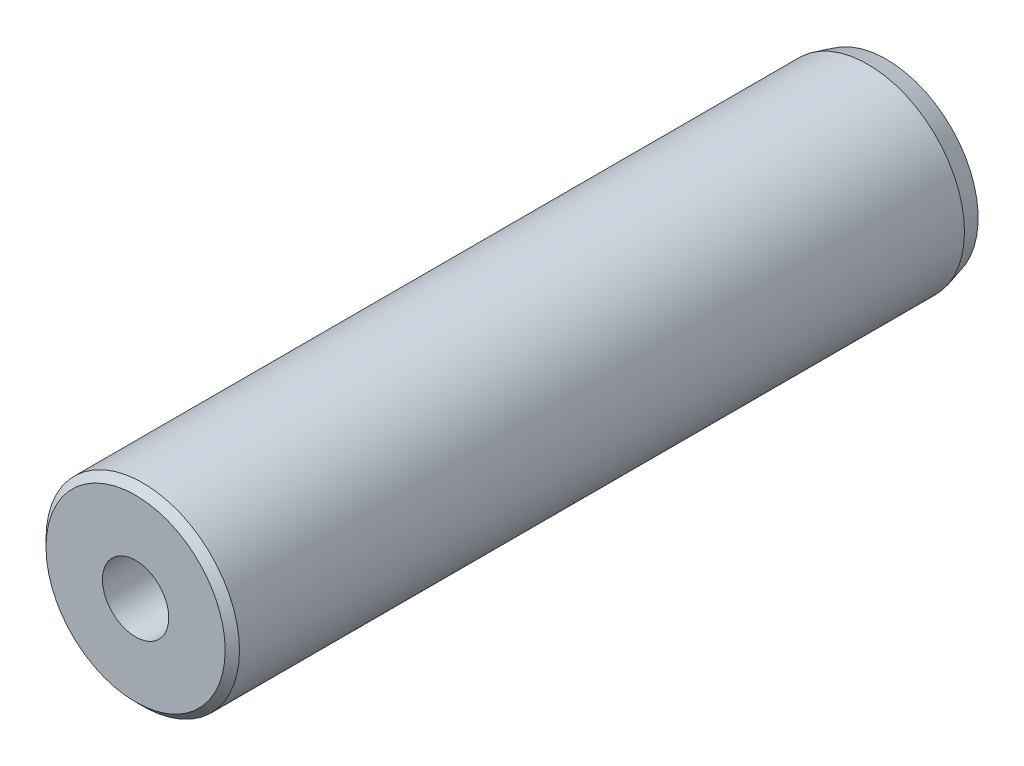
from build123d import *


with BuildPart() as part:
    # Logo3_bib1 → Revolve1 (revolve)
    with BuildSketch(Plane(origin=(0, 0, 0), x_dir=(-1, 0, 0), z_dir=(0, -1, 0))):
        with BuildLine():
            Line((0, 38.1), (0, -26.214336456))
            Line((0, -26.214336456), (3.2639, -28.09875))
            Line((3.2639, -28.09875), (3.2639, -38.1))
            Line((3.2639, -38.1), (8.82015, -38.1))
            Line((8.82015, -38.1), (9.525, -37.39515))
            Line((9.525, -37.39515), (9.525, 33.982698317))
            Line((9.525, 33.982698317), (9.031949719, 35.822787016))
            ThreePointArc((9.031949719, 35.822787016), (4.657301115, 37.521925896), (0, 38.1))
        make_face()
    revolve(axis=Axis((0, 0, -41.537203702), (0, 0, 1)))


solid = part.part
